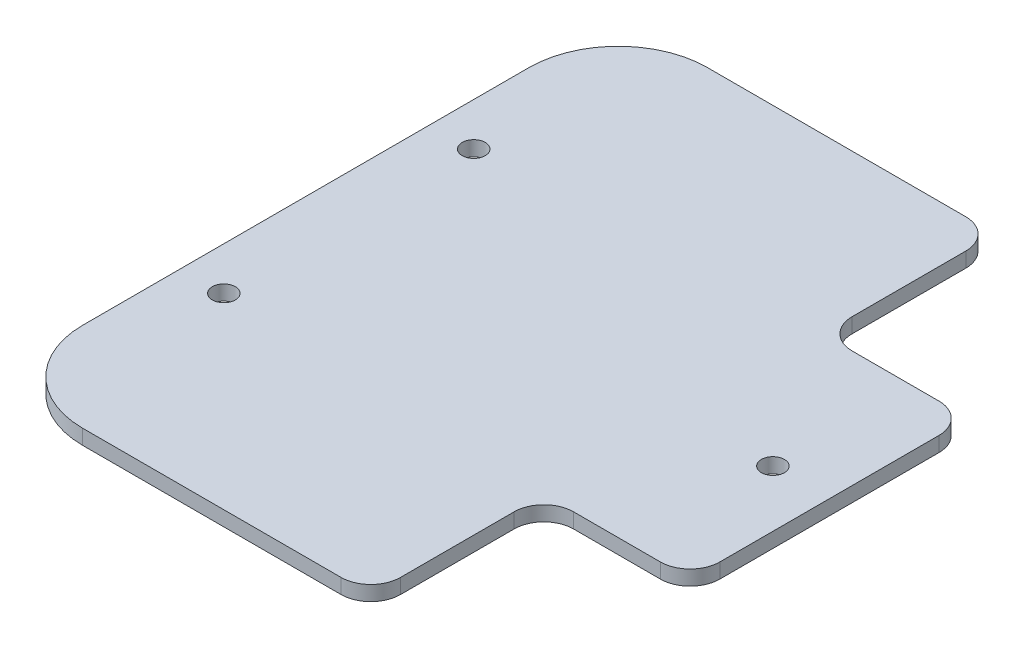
from build123d import *

# Parameters (mm, degrees)
BOSS_EXTRUDE1_DEPTH          = 3.175
F_10_0_1935_DIAMETER_HOLE1_D = 4.9149


with BuildPart() as part:
    # Sketch1 → Boss-Extrude1 (new body)
    with BuildSketch(Plane(origin=(0, 0, 0), x_dir=(1, 0, 0), z_dir=(0, 1, 0))):
        with BuildLine():
            Line((54.61, 29.735426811), (36.085426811, 29.735426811))
            ThreePointArc((36.085426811, 29.735426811), (31.59529875, 31.59529875), (29.735426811, 36.085426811))
            Line((29.735426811, 36.085426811), (29.735426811, 60.325))
            ThreePointArc((29.735426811, 60.325), (27.875554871, 64.815128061), (23.385426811, 66.675))
            Line((23.385426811, 66.675), (-31.75, 66.675))
            ThreePointArc((-31.75, 66.675), (-45.220384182, 61.095384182), (-50.8, 47.625))
            Line((-50.8, 47.625), (-50.8, -47.625))
            ThreePointArc((-50.8, -47.625), (-45.220384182, -61.095384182), (-31.75, -66.675))
            Line((-31.75, -66.675), (23.385426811, -66.675))
            ThreePointArc((23.385426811, -66.675), (27.875554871, -64.815128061), (29.735426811, -60.325))
            Line((29.735426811, -60.325), (29.735426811, -36.085426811))
            ThreePointArc((29.735426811, -36.085426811), (31.59529875, -31.59529875), (36.085426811, -29.735426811))
            Line((36.085426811, -29.735426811), (54.61, -29.735426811))
            ThreePointArc((54.61, -29.735426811), (59.100128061, -27.875554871), (60.96, -23.385426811))
            Line((60.96, -23.385426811), (60.96, 23.385426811))
            ThreePointArc((60.96, 23.385426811), (59.100128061, 27.875554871), (54.61, 29.735426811))
        make_face()
    extrude(amount=BOSS_EXTRUDE1_DEPTH)

    # 10 _0.1935_ Diameter Hole1 (through all)
    with Locations(Plane(origin=(0, 3.175, 0), x_dir=(1, 0, 0), z_dir=(0, 1, 0))):
        with Locations((48.895, 0), (-41.635551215, 26.67), (-41.635551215, -26.67)):
            Hole(F_10_0_1935_DIAMETER_HOLE1_D / 2)


solid = part.part
